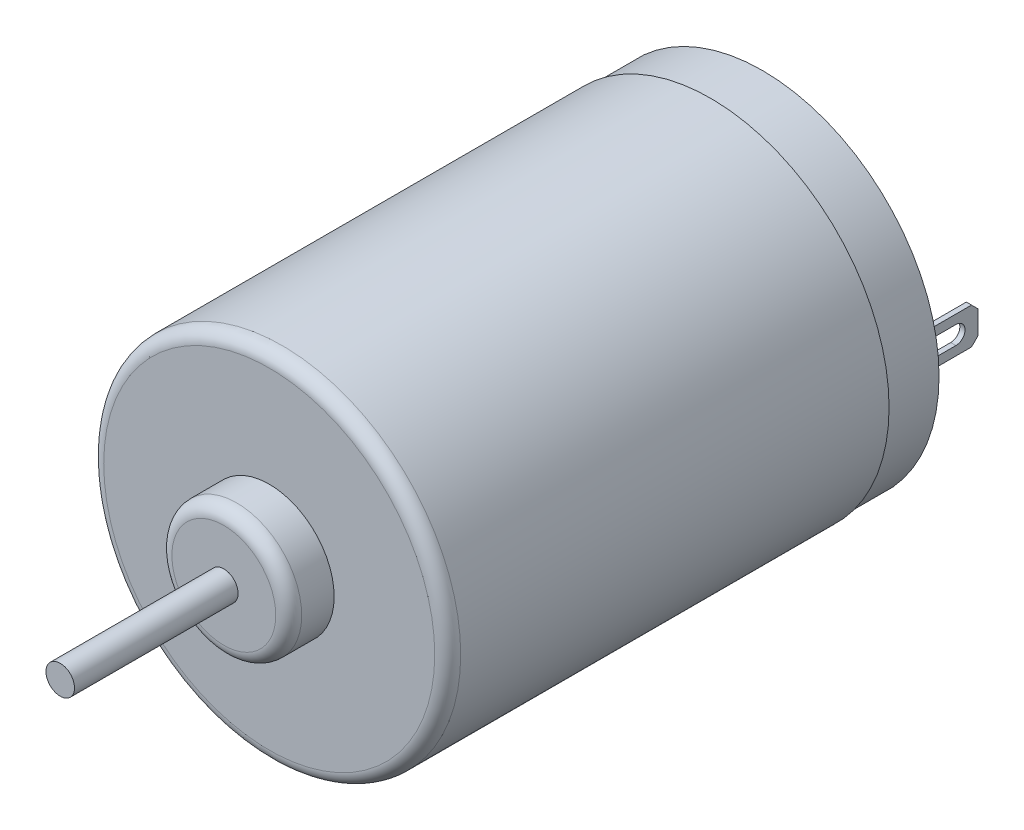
ISO-10303-21;
HEADER;
FILE_DESCRIPTION(('STEP AP214'),'2;1');
FILE_NAME('part.step','',(''),(''),'','','');
FILE_SCHEMA(('AUTOMOTIVE_DESIGN { 1 0 10303 214 1 1 1 1 }'));
ENDSEC;
DATA;
#1=APPLICATION_CONTEXT('core data for automotive mechanical design processes');
#2=APPLICATION_PROTOCOL_DEFINITION('international standard','automotive_design',2000,#1);
#3=PRODUCT_CONTEXT('',#1,'mechanical');
#4=PRODUCT('Part','Part','',(#3));
#5=PRODUCT_RELATED_PRODUCT_CATEGORY('part','',(#4));
#6=PRODUCT_DEFINITION_FORMATION('','',#4);
#7=PRODUCT_DEFINITION_CONTEXT('part definition',#1,'design');
#8=PRODUCT_DEFINITION('design','',#6,#7);
#9=PRODUCT_DEFINITION_SHAPE('','',#8);
#10=(LENGTH_UNIT() NAMED_UNIT(*) SI_UNIT(.MILLI.,.METRE.));
#11=(NAMED_UNIT(*) PLANE_ANGLE_UNIT() SI_UNIT($,.RADIAN.));
#12=(NAMED_UNIT(*) SI_UNIT($,.STERADIAN.) SOLID_ANGLE_UNIT());
#13=UNCERTAINTY_MEASURE_WITH_UNIT(LENGTH_MEASURE(1.E-05),#10,'distance_accuracy_value','');
#14=(GEOMETRIC_REPRESENTATION_CONTEXT(3) GLOBAL_UNCERTAINTY_ASSIGNED_CONTEXT((#13)) GLOBAL_UNIT_ASSIGNED_CONTEXT((#10,
#11,#12)) REPRESENTATION_CONTEXT('',''));
#15=CARTESIAN_POINT('',(0.,0.,0.));
#16=DIRECTION('',(0.,0.,1.));
#17=DIRECTION('',(1.,0.,0.));
#18=AXIS2_PLACEMENT_3D('',#15,#16,#17);
#19=CARTESIAN_POINT('',(-11.5,1.4,-9.1));
#20=DIRECTION('',(-1.,0.,0.));
#21=DIRECTION('',(0.,0.,1.));
#22=AXIS2_PLACEMENT_3D('',#19,#20,#21);
#23=PLANE('',#22);
#24=DIRECTION('',(0.,0.,-1.));
#25=VECTOR('',#24,1.);
#26=CARTESIAN_POINT('',(-11.5,-0.7,-5.8));
#27=LINE('',#26,#25);
#28=CARTESIAN_POINT('',(-11.5,-0.7,-5.8));
#29=VERTEX_POINT('',#28);
#30=CARTESIAN_POINT('',(-11.5,-0.7,-7.4));
#31=VERTEX_POINT('',#30);
#32=EDGE_CURVE('E364',#29,#31,#27,.T.);
#33=ORIENTED_EDGE('',*,*,#32,.T.);
#34=CARTESIAN_POINT('',(-11.5,0.,-7.4));
#35=DIRECTION('',(1.,0.,0.));
#36=DIRECTION('',(0.,0.,-1.));
#37=AXIS2_PLACEMENT_3D('',#34,#35,#36);
#38=CIRCLE('',#37,0.7);
#39=CARTESIAN_POINT('',(-11.5,0.7,-7.4));
#40=VERTEX_POINT('',#39);
#41=EDGE_CURVE('E361',#31,#40,#38,.T.);
#42=ORIENTED_EDGE('',*,*,#41,.T.);
#43=DIRECTION('',(0.,0.,1.));
#44=VECTOR('',#43,1.);
#45=CARTESIAN_POINT('',(-11.5,0.7,-5.8));
#46=LINE('',#45,#44);
#47=CARTESIAN_POINT('',(-11.5,0.7,-5.8));
#48=VERTEX_POINT('',#47);
#49=EDGE_CURVE('E374',#40,#48,#46,.T.);
#50=ORIENTED_EDGE('',*,*,#49,.T.);
#51=CARTESIAN_POINT('',(-11.5,0.,-5.8));
#52=DIRECTION('',(1.,0.,0.));
#53=DIRECTION('',(0.,0.,1.));
#54=AXIS2_PLACEMENT_3D('',#51,#52,#53);
#55=CIRCLE('',#54,0.7);
#56=EDGE_CURVE('E371',#48,#29,#55,.T.);
#57=ORIENTED_EDGE('',*,*,#56,.T.);
#58=EDGE_LOOP('',(#33,#42,#50,#57));
#59=FACE_BOUND('',#58,.T.);
#60=DIRECTION('',(0.,-1.,0.));
#61=VECTOR('',#60,1.);
#62=CARTESIAN_POINT('',(-11.5,1.4,-9.1));
#63=LINE('',#62,#61);
#64=CARTESIAN_POINT('',(-11.5,0.9,-9.1));
#65=VERTEX_POINT('',#64);
#66=CARTESIAN_POINT('',(-11.5,-0.9,-9.1));
#67=VERTEX_POINT('',#66);
#68=EDGE_CURVE('E181',#65,#67,#63,.T.);
#69=ORIENTED_EDGE('',*,*,#68,.T.);
#70=DIRECTION('',(0.,-0.707106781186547,0.707106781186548));
#71=VECTOR('',#70,1.);
#72=CARTESIAN_POINT('',(-11.5,-1.4,-8.6));
#73=LINE('',#72,#71);
#74=CARTESIAN_POINT('',(-11.5,-1.4,-8.6));
#75=VERTEX_POINT('',#74);
#76=EDGE_CURVE('E169',#67,#75,#73,.T.);
#77=ORIENTED_EDGE('',*,*,#76,.T.);
#78=DIRECTION('',(0.,0.,1.));
#79=VECTOR('',#78,1.);
#80=CARTESIAN_POINT('',(-11.5,-1.4,-9.1));
#81=LINE('',#80,#79);
#82=CARTESIAN_POINT('',(-11.5,-1.4,-4.));
#83=VERTEX_POINT('',#82);
#84=EDGE_CURVE('E188',#75,#83,#81,.T.);
#85=ORIENTED_EDGE('',*,*,#84,.T.);
#86=DIRECTION('',(0.,-1.,0.));
#87=VECTOR('',#86,1.);
#88=CARTESIAN_POINT('',(-11.5,1.4,-4.));
#89=LINE('',#88,#87);
#90=CARTESIAN_POINT('',(-11.5,1.4,-4.));
#91=VERTEX_POINT('',#90);
#92=EDGE_CURVE('E197',#91,#83,#89,.T.);
#93=ORIENTED_EDGE('',*,*,#92,.F.);
#94=DIRECTION('',(0.,0.,1.));
#95=VECTOR('',#94,1.);
#96=CARTESIAN_POINT('',(-11.5,1.4,-9.1));
#97=LINE('',#96,#95);
#98=CARTESIAN_POINT('',(-11.5,1.4,-8.6));
#99=VERTEX_POINT('',#98);
#100=EDGE_CURVE('E211',#99,#91,#97,.T.);
#101=ORIENTED_EDGE('',*,*,#100,.F.);
#102=DIRECTION('',(0.,-0.707106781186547,-0.707106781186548));
#103=VECTOR('',#102,1.);
#104=CARTESIAN_POINT('',(-11.5,1.4,-8.6));
#105=LINE('',#104,#103);
#106=EDGE_CURVE('E185',#99,#65,#105,.T.);
#107=ORIENTED_EDGE('',*,*,#106,.T.);
#108=EDGE_LOOP('',(#69,#77,#85,#93,#101,#107));
#109=FACE_BOUND('',#108,.T.);
#110=ADVANCED_FACE('F34',(#59,#109),#23,.T.);
#111=CARTESIAN_POINT('',(-11.1,1.4,-9.1));
#112=DIRECTION('',(1.,0.,0.));
#113=DIRECTION('',(0.,0.,-1.));
#114=AXIS2_PLACEMENT_3D('',#111,#112,#113);
#115=PLANE('',#114);
#116=DIRECTION('',(0.,0.,-1.));
#117=VECTOR('',#116,1.);
#118=CARTESIAN_POINT('',(-11.1,0.7,-9.1));
#119=LINE('',#118,#117);
#120=CARTESIAN_POINT('',(-11.1,0.7,-5.8));
#121=VERTEX_POINT('',#120);
#122=CARTESIAN_POINT('',(-11.1,0.7,-7.4));
#123=VERTEX_POINT('',#122);
#124=EDGE_CURVE('E350',#121,#123,#119,.T.);
#125=ORIENTED_EDGE('',*,*,#124,.T.);
#126=CARTESIAN_POINT('',(-11.1,0.,-7.4));
#127=DIRECTION('',(1.,0.,0.));
#128=DIRECTION('',(0.,0.,-1.));
#129=AXIS2_PLACEMENT_3D('',#126,#127,#128);
#130=CIRCLE('',#129,0.7);
#131=CARTESIAN_POINT('',(-11.1,-0.7,-7.4));
#132=VERTEX_POINT('',#131);
#133=EDGE_CURVE('E353',#123,#132,#130,.F.);
#134=ORIENTED_EDGE('',*,*,#133,.T.);
#135=DIRECTION('',(0.,0.,1.));
#136=VECTOR('',#135,1.);
#137=CARTESIAN_POINT('',(-11.1,-0.7,-9.1));
#138=LINE('',#137,#136);
#139=CARTESIAN_POINT('',(-11.1,-0.7,-5.8));
#140=VERTEX_POINT('',#139);
#141=EDGE_CURVE('E344',#132,#140,#138,.T.);
#142=ORIENTED_EDGE('',*,*,#141,.T.);
#143=CARTESIAN_POINT('',(-11.1,0.,-5.8));
#144=DIRECTION('',(1.,0.,0.));
#145=DIRECTION('',(0.,0.,-1.));
#146=AXIS2_PLACEMENT_3D('',#143,#144,#145);
#147=CIRCLE('',#146,0.7);
#148=EDGE_CURVE('E347',#140,#121,#147,.F.);
#149=ORIENTED_EDGE('',*,*,#148,.T.);
#150=EDGE_LOOP('',(#125,#134,#142,#149));
#151=FACE_BOUND('',#150,.T.);
#152=DIRECTION('',(0.,0.,1.));
#153=VECTOR('',#152,1.);
#154=CARTESIAN_POINT('',(-11.1,-1.4,-9.1));
#155=LINE('',#154,#153);
#156=CARTESIAN_POINT('',(-11.1,-1.4,-8.6));
#157=VERTEX_POINT('',#156);
#158=CARTESIAN_POINT('',(-11.1,-1.4,-4.));
#159=VERTEX_POINT('',#158);
#160=EDGE_CURVE('E207',#157,#159,#155,.T.);
#161=ORIENTED_EDGE('',*,*,#160,.F.);
#162=DIRECTION('',(0.,0.707106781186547,-0.707106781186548));
#163=VECTOR('',#162,1.);
#164=CARTESIAN_POINT('',(-11.1,0.249999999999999,-10.25));
#165=LINE('',#164,#163);
#166=CARTESIAN_POINT('',(-11.1,-0.9,-9.1));
#167=VERTEX_POINT('',#166);
#168=EDGE_CURVE('E49',#157,#167,#165,.T.);
#169=ORIENTED_EDGE('',*,*,#168,.T.);
#170=DIRECTION('',(0.,1.,0.));
#171=VECTOR('',#170,1.);
#172=CARTESIAN_POINT('',(-11.1,1.4,-9.1));
#173=LINE('',#172,#171);
#174=CARTESIAN_POINT('',(-11.1,0.9,-9.1));
#175=VERTEX_POINT('',#174);
#176=EDGE_CURVE('E55',#167,#175,#173,.T.);
#177=ORIENTED_EDGE('',*,*,#176,.T.);
#178=DIRECTION('',(0.,0.707106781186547,0.707106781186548));
#179=VECTOR('',#178,1.);
#180=CARTESIAN_POINT('',(-11.1,1.15,-8.85));
#181=LINE('',#180,#179);
#182=CARTESIAN_POINT('',(-11.1,1.4,-8.6));
#183=VERTEX_POINT('',#182);
#184=EDGE_CURVE('E358',#175,#183,#181,.T.);
#185=ORIENTED_EDGE('',*,*,#184,.T.);
#186=DIRECTION('',(0.,0.,1.));
#187=VECTOR('',#186,1.);
#188=CARTESIAN_POINT('',(-11.1,1.4,-9.1));
#189=LINE('',#188,#187);
#190=CARTESIAN_POINT('',(-11.1,1.4,-4.));
#191=VERTEX_POINT('',#190);
#192=EDGE_CURVE('E209',#183,#191,#189,.T.);
#193=ORIENTED_EDGE('',*,*,#192,.T.);
#194=DIRECTION('',(0.,1.,0.));
#195=VECTOR('',#194,1.);
#196=CARTESIAN_POINT('',(-11.1,1.4,-4.));
#197=LINE('',#196,#195);
#198=EDGE_CURVE('E191',#159,#191,#197,.T.);
#199=ORIENTED_EDGE('',*,*,#198,.F.);
#200=EDGE_LOOP('',(#161,#169,#177,#185,#193,#199));
#201=FACE_BOUND('',#200,.T.);
#202=ADVANCED_FACE('F395',(#151,#201),#115,.T.);
#203=CARTESIAN_POINT('',(-11.5,-1.4,-9.1));
#204=DIRECTION('',(0.,0.,-1.));
#205=DIRECTION('',(1.,0.,0.));
#206=AXIS2_PLACEMENT_3D('',#203,#204,#205);
#207=PLANE('',#206);
#208=ORIENTED_EDGE('',*,*,#176,.F.);
#209=DIRECTION('',(-1.,0.,0.));
#210=VECTOR('',#209,1.);
#211=CARTESIAN_POINT('',(-11.,-0.9,-9.1));
#212=LINE('',#211,#210);
#213=EDGE_CURVE('E172',#167,#67,#212,.T.);
#214=ORIENTED_EDGE('',*,*,#213,.T.);
#215=ORIENTED_EDGE('',*,*,#68,.F.);
#216=DIRECTION('',(1.,0.,0.));
#217=VECTOR('',#216,1.);
#218=CARTESIAN_POINT('',(-11.5,0.9,-9.1));
#219=LINE('',#218,#217);
#220=EDGE_CURVE('E42',#65,#175,#219,.T.);
#221=ORIENTED_EDGE('',*,*,#220,.T.);
#222=EDGE_LOOP('',(#208,#214,#215,#221));
#223=FACE_BOUND('',#222,.T.);
#224=ADVANCED_FACE('F179',(#223),#207,.T.);
#225=CARTESIAN_POINT('',(-11.5,-1.4,-9.1));
#226=DIRECTION('',(0.,-1.,0.));
#227=DIRECTION('',(0.,0.,-1.));
#228=AXIS2_PLACEMENT_3D('',#225,#226,#227);
#229=PLANE('',#228);
#230=ORIENTED_EDGE('',*,*,#84,.F.);
#231=DIRECTION('',(1.,0.,0.));
#232=VECTOR('',#231,1.);
#233=CARTESIAN_POINT('',(-11.5,-1.4,-8.6));
#234=LINE('',#233,#232);
#235=EDGE_CURVE('E11',#75,#157,#234,.T.);
#236=ORIENTED_EDGE('',*,*,#235,.T.);
#237=ORIENTED_EDGE('',*,*,#160,.T.);
#238=DIRECTION('',(1.,0.,0.));
#239=VECTOR('',#238,1.);
#240=CARTESIAN_POINT('',(-11.5,-1.4,-4.));
#241=LINE('',#240,#239);
#242=EDGE_CURVE('E186',#83,#159,#241,.T.);
#243=ORIENTED_EDGE('',*,*,#242,.F.);
#244=EDGE_LOOP('',(#230,#236,#237,#243));
#245=FACE_BOUND('',#244,.T.);
#246=ADVANCED_FACE('F573',(#245),#229,.T.);
#247=CARTESIAN_POINT('',(-11.5,1.4,-9.1));
#248=DIRECTION('',(0.,1.,0.));
#249=DIRECTION('',(0.,0.,1.));
#250=AXIS2_PLACEMENT_3D('',#247,#248,#249);
#251=PLANE('',#250);
#252=ORIENTED_EDGE('',*,*,#192,.F.);
#253=DIRECTION('',(-1.,0.,0.));
#254=VECTOR('',#253,1.);
#255=CARTESIAN_POINT('',(-11.,1.4,-8.6));
#256=LINE('',#255,#254);
#257=EDGE_CURVE('E359',#183,#99,#256,.T.);
#258=ORIENTED_EDGE('',*,*,#257,.T.);
#259=ORIENTED_EDGE('',*,*,#100,.T.);
#260=DIRECTION('',(-1.,0.,0.));
#261=VECTOR('',#260,1.);
#262=CARTESIAN_POINT('',(-11.5,1.4,-4.));
#263=LINE('',#262,#261);
#264=EDGE_CURVE('E200',#191,#91,#263,.T.);
#265=ORIENTED_EDGE('',*,*,#264,.F.);
#266=EDGE_LOOP('',(#252,#258,#259,#265));
#267=FACE_BOUND('',#266,.T.);
#268=ADVANCED_FACE('F416',(#267),#251,.T.);
#269=CARTESIAN_POINT('',(0.,0.,-4.));
#270=DIRECTION('',(0.,0.,-1.));
#271=DIRECTION('',(-1.,0.,0.));
#272=AXIS2_PLACEMENT_3D('',#269,#270,#271);
#273=PLANE('',#272);
#274=ORIENTED_EDGE('',*,*,#92,.T.);
#275=ORIENTED_EDGE('',*,*,#242,.T.);
#276=ORIENTED_EDGE('',*,*,#198,.T.);
#277=ORIENTED_EDGE('',*,*,#264,.T.);
#278=EDGE_LOOP('',(#274,#275,#276,#277));
#279=FACE_BOUND('',#278,.T.);
#280=CARTESIAN_POINT('',(0.,0.,-4.));
#281=DIRECTION('',(0.,0.,-1.));
#282=DIRECTION('',(-1.,0.,0.));
#283=AXIS2_PLACEMENT_3D('',#280,#281,#282);
#284=CIRCLE('',#283,13.6);
#285=CARTESIAN_POINT('',(-13.6,0.,-4.));
#286=VERTEX_POINT('',#285);
#287=EDGE_CURVE('E295',#286,#286,#284,.T.);
#288=ORIENTED_EDGE('',*,*,#287,.T.);
#289=EDGE_LOOP('',(#288));
#290=FACE_BOUND('',#289,.T.);
#291=CARTESIAN_POINT('',(0.,0.,-4.));
#292=DIRECTION('',(0.,0.,-1.));
#293=DIRECTION('',(-1.,0.,0.));
#294=AXIS2_PLACEMENT_3D('',#291,#292,#293);
#295=CIRCLE('',#294,10.8454911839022);
#296=CARTESIAN_POINT('',(-10.8454911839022,0.,-4.));
#297=VERTEX_POINT('',#296);
#298=EDGE_CURVE('E289',#297,#297,#295,.T.);
#299=ORIENTED_EDGE('',*,*,#298,.F.);
#300=EDGE_LOOP('',(#299));
#301=FACE_BOUND('',#300,.T.);
#302=DIRECTION('',(-1.,0.,0.));
#303=VECTOR('',#302,1.);
#304=CARTESIAN_POINT('',(11.5,-1.4,-4.));
#305=LINE('',#304,#303);
#306=CARTESIAN_POINT('',(11.5,-1.4,-4.));
#307=VERTEX_POINT('',#306);
#308=CARTESIAN_POINT('',(11.1,-1.4,-4.));
#309=VERTEX_POINT('',#308);
#310=EDGE_CURVE('E258',#307,#309,#305,.T.);
#311=ORIENTED_EDGE('',*,*,#310,.F.);
#312=DIRECTION('',(0.,-1.,0.));
#313=VECTOR('',#312,1.);
#314=CARTESIAN_POINT('',(11.5,1.4,-4.));
#315=LINE('',#314,#313);
#316=CARTESIAN_POINT('',(11.5,1.4,-4.));
#317=VERTEX_POINT('',#316);
#318=EDGE_CURVE('E242',#317,#307,#315,.T.);
#319=ORIENTED_EDGE('',*,*,#318,.F.);
#320=DIRECTION('',(1.,0.,0.));
#321=VECTOR('',#320,1.);
#322=CARTESIAN_POINT('',(11.5,1.4,-4.));
#323=LINE('',#322,#321);
#324=CARTESIAN_POINT('',(11.1,1.4,-4.));
#325=VERTEX_POINT('',#324);
#326=EDGE_CURVE('E253',#325,#317,#323,.T.);
#327=ORIENTED_EDGE('',*,*,#326,.F.);
#328=DIRECTION('',(0.,1.,0.));
#329=VECTOR('',#328,1.);
#330=CARTESIAN_POINT('',(11.1,1.4,-4.));
#331=LINE('',#330,#329);
#332=EDGE_CURVE('E261',#309,#325,#331,.T.);
#333=ORIENTED_EDGE('',*,*,#332,.F.);
#334=EDGE_LOOP('',(#311,#319,#327,#333));
#335=FACE_BOUND('',#334,.T.);
#336=ADVANCED_FACE('F475',(#279,#290,#301,#335),#273,.T.);
#337=CARTESIAN_POINT('',(0.,0.,-6.2));
#338=DIRECTION('',(0.,0.,-1.));
#339=DIRECTION('',(-1.,0.,0.));
#340=AXIS2_PLACEMENT_3D('',#337,#338,#339);
#341=PLANE('',#340);
#342=CARTESIAN_POINT('',(0.,0.,-6.2));
#343=DIRECTION('',(0.,0.,-1.));
#344=DIRECTION('',(-1.,0.,0.));
#345=AXIS2_PLACEMENT_3D('',#342,#343,#344);
#346=CIRCLE('',#345,5.);
#347=CARTESIAN_POINT('',(-5.,0.,-6.2));
#348=VERTEX_POINT('',#347);
#349=EDGE_CURVE('E280',#348,#348,#346,.T.);
#350=ORIENTED_EDGE('',*,*,#349,.T.);
#351=EDGE_LOOP('',(#350));
#352=FACE_BOUND('',#351,.T.);
#353=CARTESIAN_POINT('',(0.,0.,-6.2));
#354=DIRECTION('',(0.,0.,-1.));
#355=DIRECTION('',(-1.,0.,0.));
#356=AXIS2_PLACEMENT_3D('',#353,#354,#355);
#357=CIRCLE('',#356,1.1);
#358=CARTESIAN_POINT('',(-1.1,0.,-6.2));
#359=VERTEX_POINT('',#358);
#360=EDGE_CURVE('E273',#359,#359,#357,.T.);
#361=ORIENTED_EDGE('',*,*,#360,.F.);
#362=EDGE_LOOP('',(#361));
#363=FACE_BOUND('',#362,.T.);
#364=ADVANCED_FACE('F471',(#352,#363),#341,.T.);
#365=CARTESIAN_POINT('',(0.,0.,-4.));
#366=DIRECTION('',(0.,0.,-1.));
#367=DIRECTION('',(-1.,0.,0.));
#368=AXIS2_PLACEMENT_3D('',#365,#366,#367);
#369=CIRCLE('',#368,6.);
#370=CARTESIAN_POINT('',(-6.,0.,-4.));
#371=VERTEX_POINT('',#370);
#372=EDGE_CURVE('E283',#371,#371,#369,.T.);
#373=ORIENTED_EDGE('',*,*,#372,.T.);
#374=EDGE_LOOP('',(#373));
#375=FACE_BOUND('',#374,.T.);
#376=CARTESIAN_POINT('',(0.,0.,-4.));
#377=DIRECTION('',(0.,0.,-1.));
#378=DIRECTION('',(-1.,0.,0.));
#379=AXIS2_PLACEMENT_3D('',#376,#377,#378);
#380=CIRCLE('',#379,5.);
#381=CARTESIAN_POINT('',(-5.,0.,-4.));
#382=VERTEX_POINT('',#381);
#383=EDGE_CURVE('E277',#382,#382,#380,.T.);
#384=ORIENTED_EDGE('',*,*,#383,.F.);
#385=EDGE_LOOP('',(#384));
#386=FACE_BOUND('',#385,.T.);
#387=ADVANCED_FACE('F474',(#375,#386),#273,.T.);
#388=CARTESIAN_POINT('',(0.,0.,0.));
#389=DIRECTION('',(0.,0.,1.));
#390=DIRECTION('',(1.,0.,0.));
#391=AXIS2_PLACEMENT_3D('',#388,#389,#390);
#392=PLANE('',#391);
#393=CARTESIAN_POINT('',(0.,0.,0.));
#394=DIRECTION('',(0.,0.,1.));
#395=DIRECTION('',(1.,0.,0.));
#396=AXIS2_PLACEMENT_3D('',#393,#394,#395);
#397=CIRCLE('',#396,13.75);
#398=CARTESIAN_POINT('',(13.75,0.,0.));
#399=VERTEX_POINT('',#398);
#400=EDGE_CURVE('E309',#399,#399,#397,.T.);
#401=ORIENTED_EDGE('',*,*,#400,.F.);
#402=EDGE_LOOP('',(#401));
#403=FACE_BOUND('',#402,.T.);
#404=CARTESIAN_POINT('',(0.,0.,0.));
#405=DIRECTION('',(0.,0.,1.));
#406=DIRECTION('',(1.,0.,0.));
#407=AXIS2_PLACEMENT_3D('',#404,#405,#406);
#408=CIRCLE('',#407,13.6);
#409=CARTESIAN_POINT('',(13.6,0.,0.));
#410=VERTEX_POINT('',#409);
#411=EDGE_CURVE('E312',#410,#410,#408,.F.);
#412=ORIENTED_EDGE('',*,*,#411,.F.);
#413=EDGE_LOOP('',(#412));
#414=FACE_BOUND('',#413,.T.);
#415=ADVANCED_FACE('F512',(#403,#414),#392,.F.);
#416=CARTESIAN_POINT('',(0.,0.,37.5));
#417=DIRECTION('',(0.,0.,1.));
#418=DIRECTION('',(1.,0.,0.));
#419=AXIS2_PLACEMENT_3D('',#416,#417,#418);
#420=PLANE('',#419);
#421=CARTESIAN_POINT('',(0.,0.,37.5));
#422=DIRECTION('',(0.,0.,1.));
#423=DIRECTION('',(1.,0.,0.));
#424=AXIS2_PLACEMENT_3D('',#421,#422,#423);
#425=CIRCLE('',#424,4.);
#426=CARTESIAN_POINT('',(4.,0.,37.5));
#427=VERTEX_POINT('',#426);
#428=EDGE_CURVE('E332',#427,#427,#425,.T.);
#429=ORIENTED_EDGE('',*,*,#428,.T.);
#430=EDGE_LOOP('',(#429));
#431=FACE_BOUND('',#430,.T.);
#432=CARTESIAN_POINT('',(0.,0.,37.5));
#433=DIRECTION('',(0.,0.,1.));
#434=DIRECTION('',(1.,0.,0.));
#435=AXIS2_PLACEMENT_3D('',#432,#433,#434);
#436=CIRCLE('',#435,1.1);
#437=CARTESIAN_POINT('',(1.1,0.,37.5));
#438=VERTEX_POINT('',#437);
#439=EDGE_CURVE('E300',#438,#438,#436,.T.);
#440=ORIENTED_EDGE('',*,*,#439,.F.);
#441=EDGE_LOOP('',(#440));
#442=FACE_BOUND('',#441,.T.);
#443=ADVANCED_FACE('F508',(#431,#442),#420,.T.);
#444=CARTESIAN_POINT('',(0.,0.,34.));
#445=DIRECTION('',(0.,0.,1.));
#446=DIRECTION('',(1.,0.,0.));
#447=AXIS2_PLACEMENT_3D('',#444,#445,#446);
#448=PLANE('',#447);
#449=CARTESIAN_POINT('',(0.,0.,34.));
#450=DIRECTION('',(0.,0.,1.));
#451=DIRECTION('',(1.,0.,0.));
#452=AXIS2_PLACEMENT_3D('',#449,#450,#451);
#453=CIRCLE('',#452,12.75);
#454=CARTESIAN_POINT('',(12.75,0.,34.));
#455=VERTEX_POINT('',#454);
#456=EDGE_CURVE('E338',#455,#455,#453,.T.);
#457=ORIENTED_EDGE('',*,*,#456,.T.);
#458=EDGE_LOOP('',(#457));
#459=FACE_BOUND('',#458,.T.);
#460=CARTESIAN_POINT('',(0.,0.,34.));
#461=DIRECTION('',(0.,0.,1.));
#462=DIRECTION('',(1.,0.,0.));
#463=AXIS2_PLACEMENT_3D('',#460,#461,#462);
#464=CIRCLE('',#463,5.);
#465=CARTESIAN_POINT('',(5.,0.,34.));
#466=VERTEX_POINT('',#465);
#467=EDGE_CURVE('E304',#466,#466,#464,.T.);
#468=ORIENTED_EDGE('',*,*,#467,.F.);
#469=EDGE_LOOP('',(#468));
#470=FACE_BOUND('',#469,.T.);
#471=ADVANCED_FACE('F511',(#459,#470),#448,.T.);
#472=CARTESIAN_POINT('',(0.,0.,34.));
#473=DIRECTION('',(0.,0.,-1.));
#474=DIRECTION('',(-1.,0.,0.));
#475=AXIS2_PLACEMENT_3D('',#472,#473,#474);
#476=CYLINDRICAL_SURFACE('',#475,13.75);
#477=CARTESIAN_POINT('',(0.,0.,33.));
#478=DIRECTION('',(0.,0.,1.));
#479=DIRECTION('',(1.,0.,0.));
#480=AXIS2_PLACEMENT_3D('',#477,#478,#479);
#481=CIRCLE('',#480,13.75);
#482=CARTESIAN_POINT('',(13.75,0.,33.));
#483=VERTEX_POINT('',#482);
#484=EDGE_CURVE('E341',#483,#483,#481,.F.);
#485=ORIENTED_EDGE('',*,*,#484,.T.);
#486=EDGE_LOOP('',(#485));
#487=FACE_BOUND('',#486,.T.);
#488=ORIENTED_EDGE('',*,*,#400,.T.);
#489=EDGE_LOOP('',(#488));
#490=FACE_BOUND('',#489,.T.);
#491=ADVANCED_FACE('F516',(#487,#490),#476,.T.);
#492=CARTESIAN_POINT('',(0.,0.,37.5));
#493=DIRECTION('',(0.,0.,-1.));
#494=DIRECTION('',(-1.,0.,0.));
#495=AXIS2_PLACEMENT_3D('',#492,#493,#494);
#496=CYLINDRICAL_SURFACE('',#495,5.);
#497=CARTESIAN_POINT('',(0.,0.,36.5));
#498=DIRECTION('',(0.,0.,1.));
#499=DIRECTION('',(1.,0.,0.));
#500=AXIS2_PLACEMENT_3D('',#497,#498,#499);
#501=CIRCLE('',#500,5.);
#502=CARTESIAN_POINT('',(5.,0.,36.5));
#503=VERTEX_POINT('',#502);
#504=EDGE_CURVE('E335',#503,#503,#501,.F.);
#505=ORIENTED_EDGE('',*,*,#504,.T.);
#506=EDGE_LOOP('',(#505));
#507=FACE_BOUND('',#506,.T.);
#508=ORIENTED_EDGE('',*,*,#467,.T.);
#509=EDGE_LOOP('',(#508));
#510=FACE_BOUND('',#509,.T.);
#511=ADVANCED_FACE('F506',(#507,#510),#496,.T.);
#512=CARTESIAN_POINT('',(0.,0.,50.1));
#513=DIRECTION('',(0.,0.,-1.));
#514=DIRECTION('',(-1.,0.,0.));
#515=AXIS2_PLACEMENT_3D('',#512,#513,#514);
#516=CYLINDRICAL_SURFACE('',#515,1.1);
#517=CARTESIAN_POINT('',(0.,0.,50.1));
#518=DIRECTION('',(0.,0.,1.));
#519=DIRECTION('',(1.,0.,0.));
#520=AXIS2_PLACEMENT_3D('',#517,#518,#519);
#521=CIRCLE('',#520,1.1);
#522=CARTESIAN_POINT('',(1.1,0.,50.1));
#523=VERTEX_POINT('',#522);
#524=EDGE_CURVE('E301',#523,#523,#521,.T.);
#525=ORIENTED_EDGE('',*,*,#524,.F.);
#526=EDGE_LOOP('',(#525));
#527=FACE_BOUND('',#526,.T.);
#528=ORIENTED_EDGE('',*,*,#439,.T.);
#529=EDGE_LOOP('',(#528));
#530=FACE_BOUND('',#529,.T.);
#531=ADVANCED_FACE('F502',(#527,#530),#516,.T.);
#532=CARTESIAN_POINT('',(0.,0.,50.1));
#533=DIRECTION('',(0.,0.,1.));
#534=DIRECTION('',(1.,0.,0.));
#535=AXIS2_PLACEMENT_3D('',#532,#533,#534);
#536=PLANE('',#535);
#537=ORIENTED_EDGE('',*,*,#524,.T.);
#538=EDGE_LOOP('',(#537));
#539=FACE_BOUND('',#538,.T.);
#540=ADVANCED_FACE('F498',(#539),#536,.T.);
#541=CARTESIAN_POINT('',(0.,0.,-4.));
#542=DIRECTION('',(0.,0.,1.));
#543=DIRECTION('',(1.,0.,0.));
#544=AXIS2_PLACEMENT_3D('',#541,#542,#543);
#545=CYLINDRICAL_SURFACE('',#544,13.6);
#546=ORIENTED_EDGE('',*,*,#287,.F.);
#547=EDGE_LOOP('',(#546));
#548=FACE_BOUND('',#547,.T.);
#549=ORIENTED_EDGE('',*,*,#411,.T.);
#550=EDGE_LOOP('',(#549));
#551=FACE_BOUND('',#550,.T.);
#552=ADVANCED_FACE('F491',(#548,#551),#545,.T.);
#553=CARTESIAN_POINT('',(0.,0.,-3.));
#554=DIRECTION('',(0.,0.,-1.));
#555=DIRECTION('',(-1.,0.,0.));
#556=AXIS2_PLACEMENT_3D('',#553,#554,#555);
#557=CYLINDRICAL_SURFACE('',#556,10.8454911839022);
#558=CARTESIAN_POINT('',(0.,0.,-3.));
#559=DIRECTION('',(0.,0.,-1.));
#560=DIRECTION('',(-1.,0.,0.));
#561=AXIS2_PLACEMENT_3D('',#558,#559,#560);
#562=CIRCLE('',#561,10.8454911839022);
#563=CARTESIAN_POINT('',(-10.8454911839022,0.,-3.));
#564=VERTEX_POINT('',#563);
#565=EDGE_CURVE('E292',#564,#564,#562,.T.);
#566=ORIENTED_EDGE('',*,*,#565,.F.);
#567=EDGE_LOOP('',(#566));
#568=FACE_BOUND('',#567,.T.);
#569=ORIENTED_EDGE('',*,*,#298,.T.);
#570=EDGE_LOOP('',(#569));
#571=FACE_BOUND('',#570,.T.);
#572=ADVANCED_FACE('F487',(#568,#571),#557,.F.);
#573=CARTESIAN_POINT('',(0.,0.,-3.));
#574=DIRECTION('',(0.,0.,-1.));
#575=DIRECTION('',(-1.,0.,0.));
#576=AXIS2_PLACEMENT_3D('',#573,#574,#575);
#577=PLANE('',#576);
#578=CARTESIAN_POINT('',(0.,0.,-3.));
#579=DIRECTION('',(0.,0.,-1.));
#580=DIRECTION('',(-1.,0.,0.));
#581=AXIS2_PLACEMENT_3D('',#578,#579,#580);
#582=CIRCLE('',#581,6.);
#583=CARTESIAN_POINT('',(-6.,0.,-3.));
#584=VERTEX_POINT('',#583);
#585=EDGE_CURVE('E286',#584,#584,#582,.T.);
#586=ORIENTED_EDGE('',*,*,#585,.F.);
#587=EDGE_LOOP('',(#586));
#588=FACE_BOUND('',#587,.T.);
#589=ORIENTED_EDGE('',*,*,#565,.T.);
#590=EDGE_LOOP('',(#589));
#591=FACE_BOUND('',#590,.T.);
#592=ADVANCED_FACE('F483',(#588,#591),#577,.T.);
#593=CARTESIAN_POINT('',(0.,0.,-3.));
#594=DIRECTION('',(0.,0.,-1.));
#595=DIRECTION('',(-1.,0.,0.));
#596=AXIS2_PLACEMENT_3D('',#593,#594,#595);
#597=CYLINDRICAL_SURFACE('',#596,6.);
#598=ORIENTED_EDGE('',*,*,#585,.T.);
#599=EDGE_LOOP('',(#598));
#600=FACE_BOUND('',#599,.T.);
#601=ORIENTED_EDGE('',*,*,#372,.F.);
#602=EDGE_LOOP('',(#601));
#603=FACE_BOUND('',#602,.T.);
#604=ADVANCED_FACE('F479',(#600,#603),#597,.T.);
#605=CARTESIAN_POINT('',(0.,0.,-6.2));
#606=DIRECTION('',(0.,0.,1.));
#607=DIRECTION('',(1.,0.,0.));
#608=AXIS2_PLACEMENT_3D('',#605,#606,#607);
#609=CYLINDRICAL_SURFACE('',#608,5.);
#610=ORIENTED_EDGE('',*,*,#349,.F.);
#611=EDGE_LOOP('',(#610));
#612=FACE_BOUND('',#611,.T.);
#613=ORIENTED_EDGE('',*,*,#383,.T.);
#614=EDGE_LOOP('',(#613));
#615=FACE_BOUND('',#614,.T.);
#616=ADVANCED_FACE('F469',(#612,#615),#609,.T.);
#617=CARTESIAN_POINT('',(0.,0.,-7.2));
#618=DIRECTION('',(0.,0.,1.));
#619=DIRECTION('',(1.,0.,0.));
#620=AXIS2_PLACEMENT_3D('',#617,#618,#619);
#621=CYLINDRICAL_SURFACE('',#620,1.1);
#622=CARTESIAN_POINT('',(0.,0.,-7.2));
#623=DIRECTION('',(0.,0.,-1.));
#624=DIRECTION('',(-1.,0.,0.));
#625=AXIS2_PLACEMENT_3D('',#622,#623,#624);
#626=CIRCLE('',#625,1.1);
#627=CARTESIAN_POINT('',(-1.1,0.,-7.2));
#628=VERTEX_POINT('',#627);
#629=EDGE_CURVE('E274',#628,#628,#626,.T.);
#630=ORIENTED_EDGE('',*,*,#629,.F.);
#631=EDGE_LOOP('',(#630));
#632=FACE_BOUND('',#631,.T.);
#633=ORIENTED_EDGE('',*,*,#360,.T.);
#634=EDGE_LOOP('',(#633));
#635=FACE_BOUND('',#634,.T.);
#636=ADVANCED_FACE('F465',(#632,#635),#621,.T.);
#637=CARTESIAN_POINT('',(0.,0.,-7.2));
#638=DIRECTION('',(0.,0.,-1.));
#639=DIRECTION('',(-1.,0.,0.));
#640=AXIS2_PLACEMENT_3D('',#637,#638,#639);
#641=PLANE('',#640);
#642=ORIENTED_EDGE('',*,*,#629,.T.);
#643=EDGE_LOOP('',(#642));
#644=FACE_BOUND('',#643,.T.);
#645=ADVANCED_FACE('F461',(#644),#641,.T.);
#646=CARTESIAN_POINT('',(11.5,1.4,-9.1));
#647=DIRECTION('',(-1.,0.,0.));
#648=DIRECTION('',(0.,0.,1.));
#649=AXIS2_PLACEMENT_3D('',#646,#647,#648);
#650=PLANE('',#649);
#651=DIRECTION('',(0.,0.,1.));
#652=VECTOR('',#651,1.);
#653=CARTESIAN_POINT('',(11.5,0.7,-5.8));
#654=LINE('',#653,#652);
#655=CARTESIAN_POINT('',(11.5,0.7,-7.4));
#656=VERTEX_POINT('',#655);
#657=CARTESIAN_POINT('',(11.5,0.7,-5.8));
#658=VERTEX_POINT('',#657);
#659=EDGE_CURVE('E230',#656,#658,#654,.T.);
#660=ORIENTED_EDGE('',*,*,#659,.F.);
#661=CARTESIAN_POINT('',(11.5,0.,-7.4));
#662=DIRECTION('',(1.,0.,0.));
#663=DIRECTION('',(0.,0.,-1.));
#664=AXIS2_PLACEMENT_3D('',#661,#662,#663);
#665=CIRCLE('',#664,0.7);
#666=CARTESIAN_POINT('',(11.5,-0.7,-7.4));
#667=VERTEX_POINT('',#666);
#668=EDGE_CURVE('E228',#667,#656,#665,.T.);
#669=ORIENTED_EDGE('',*,*,#668,.F.);
#670=DIRECTION('',(0.,0.,-1.));
#671=VECTOR('',#670,1.);
#672=CARTESIAN_POINT('',(11.5,-0.7,-5.8));
#673=LINE('',#672,#671);
#674=CARTESIAN_POINT('',(11.5,-0.7,-5.8));
#675=VERTEX_POINT('',#674);
#676=EDGE_CURVE('E236',#675,#667,#673,.T.);
#677=ORIENTED_EDGE('',*,*,#676,.F.);
#678=CARTESIAN_POINT('',(11.5,0.,-5.8));
#679=DIRECTION('',(1.,0.,0.));
#680=DIRECTION('',(0.,0.,1.));
#681=AXIS2_PLACEMENT_3D('',#678,#679,#680);
#682=CIRCLE('',#681,0.7);
#683=EDGE_CURVE('E233',#658,#675,#682,.T.);
#684=ORIENTED_EDGE('',*,*,#683,.F.);
#685=EDGE_LOOP('',(#660,#669,#677,#684));
#686=FACE_BOUND('',#685,.T.);
#687=DIRECTION('',(0.,0.,1.));
#688=VECTOR('',#687,1.);
#689=CARTESIAN_POINT('',(11.5,-1.4,-9.1));
#690=LINE('',#689,#688);
#691=CARTESIAN_POINT('',(11.5,-1.4,-8.6));
#692=VERTEX_POINT('',#691);
#693=EDGE_CURVE('E271',#692,#307,#690,.T.);
#694=ORIENTED_EDGE('',*,*,#693,.F.);
#695=DIRECTION('',(0.,-0.707106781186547,0.707106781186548));
#696=VECTOR('',#695,1.);
#697=CARTESIAN_POINT('',(11.5,-1.4,-8.6));
#698=LINE('',#697,#696);
#699=CARTESIAN_POINT('',(11.5,-0.9,-9.1));
#700=VERTEX_POINT('',#699);
#701=EDGE_CURVE('E213',#700,#692,#698,.T.);
#702=ORIENTED_EDGE('',*,*,#701,.F.);
#703=DIRECTION('',(0.,-1.,0.));
#704=VECTOR('',#703,1.);
#705=CARTESIAN_POINT('',(11.5,1.4,-9.1));
#706=LINE('',#705,#704);
#707=CARTESIAN_POINT('',(11.5,0.9,-9.1));
#708=VERTEX_POINT('',#707);
#709=EDGE_CURVE('E249',#708,#700,#706,.T.);
#710=ORIENTED_EDGE('',*,*,#709,.F.);
#711=DIRECTION('',(0.,-0.707106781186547,-0.707106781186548));
#712=VECTOR('',#711,1.);
#713=CARTESIAN_POINT('',(11.5,1.4,-8.6));
#714=LINE('',#713,#712);
#715=CARTESIAN_POINT('',(11.5,1.4,-8.6));
#716=VERTEX_POINT('',#715);
#717=EDGE_CURVE('E221',#716,#708,#714,.T.);
#718=ORIENTED_EDGE('',*,*,#717,.F.);
#719=DIRECTION('',(0.,0.,1.));
#720=VECTOR('',#719,1.);
#721=CARTESIAN_POINT('',(11.5,1.4,-9.1));
#722=LINE('',#721,#720);
#723=EDGE_CURVE('E255',#716,#317,#722,.T.);
#724=ORIENTED_EDGE('',*,*,#723,.T.);
#725=ORIENTED_EDGE('',*,*,#318,.T.);
#726=EDGE_LOOP('',(#694,#702,#710,#718,#724,#725));
#727=FACE_BOUND('',#726,.T.);
#728=ADVANCED_FACE('F457',(#686,#727),#650,.F.);
#729=CARTESIAN_POINT('',(11.5,-1.4,-9.1));
#730=DIRECTION('',(0.,1.,0.));
#731=DIRECTION('',(0.,0.,1.));
#732=AXIS2_PLACEMENT_3D('',#729,#730,#731);
#733=PLANE('',#732);
#734=DIRECTION('',(0.,0.,1.));
#735=VECTOR('',#734,1.);
#736=CARTESIAN_POINT('',(11.1,-1.4,-9.1));
#737=LINE('',#736,#735);
#738=CARTESIAN_POINT('',(11.1,-1.4,-8.6));
#739=VERTEX_POINT('',#738);
#740=EDGE_CURVE('E269',#739,#309,#737,.T.);
#741=ORIENTED_EDGE('',*,*,#740,.F.);
#742=DIRECTION('',(1.,0.,0.));
#743=VECTOR('',#742,1.);
#744=CARTESIAN_POINT('',(11.,-1.4,-8.6));
#745=LINE('',#744,#743);
#746=EDGE_CURVE('E215',#739,#692,#745,.T.);
#747=ORIENTED_EDGE('',*,*,#746,.T.);
#748=ORIENTED_EDGE('',*,*,#693,.T.);
#749=ORIENTED_EDGE('',*,*,#310,.T.);
#750=EDGE_LOOP('',(#741,#747,#748,#749));
#751=FACE_BOUND('',#750,.T.);
#752=ADVANCED_FACE('F453',(#751),#733,.F.);
#753=CARTESIAN_POINT('',(11.1,1.4,-9.1));
#754=DIRECTION('',(1.,0.,0.));
#755=DIRECTION('',(0.,0.,-1.));
#756=AXIS2_PLACEMENT_3D('',#753,#754,#755);
#757=PLANE('',#756);
#758=DIRECTION('',(0.,0.,-1.));
#759=VECTOR('',#758,1.);
#760=CARTESIAN_POINT('',(11.1,-0.7,-9.1));
#761=LINE('',#760,#759);
#762=CARTESIAN_POINT('',(11.1,-0.7,-5.8));
#763=VERTEX_POINT('',#762);
#764=CARTESIAN_POINT('',(11.1,-0.7,-7.4));
#765=VERTEX_POINT('',#764);
#766=EDGE_CURVE('E321',#763,#765,#761,.T.);
#767=ORIENTED_EDGE('',*,*,#766,.T.);
#768=CARTESIAN_POINT('',(11.1,0.,-7.4));
#769=DIRECTION('',(1.,0.,0.));
#770=DIRECTION('',(0.,0.,-1.));
#771=AXIS2_PLACEMENT_3D('',#768,#769,#770);
#772=CIRCLE('',#771,0.7);
#773=CARTESIAN_POINT('',(11.1,0.7,-7.4));
#774=VERTEX_POINT('',#773);
#775=EDGE_CURVE('E324',#765,#774,#772,.T.);
#776=ORIENTED_EDGE('',*,*,#775,.T.);
#777=DIRECTION('',(0.,0.,1.));
#778=VECTOR('',#777,1.);
#779=CARTESIAN_POINT('',(11.1,0.7,-9.1));
#780=LINE('',#779,#778);
#781=CARTESIAN_POINT('',(11.1,0.7,-5.8));
#782=VERTEX_POINT('',#781);
#783=EDGE_CURVE('E315',#774,#782,#780,.T.);
#784=ORIENTED_EDGE('',*,*,#783,.T.);
#785=CARTESIAN_POINT('',(11.1,0.,-5.8));
#786=DIRECTION('',(1.,0.,0.));
#787=DIRECTION('',(0.,0.,-1.));
#788=AXIS2_PLACEMENT_3D('',#785,#786,#787);
#789=CIRCLE('',#788,0.7);
#790=EDGE_CURVE('E318',#782,#763,#789,.T.);
#791=ORIENTED_EDGE('',*,*,#790,.T.);
#792=EDGE_LOOP('',(#767,#776,#784,#791));
#793=FACE_BOUND('',#792,.T.);
#794=DIRECTION('',(0.,1.,0.));
#795=VECTOR('',#794,1.);
#796=CARTESIAN_POINT('',(11.1,1.4,-9.1));
#797=LINE('',#796,#795);
#798=CARTESIAN_POINT('',(11.1,-0.9,-9.1));
#799=VERTEX_POINT('',#798);
#800=CARTESIAN_POINT('',(11.1,0.9,-9.1));
#801=VERTEX_POINT('',#800);
#802=EDGE_CURVE('E252',#799,#801,#797,.T.);
#803=ORIENTED_EDGE('',*,*,#802,.F.);
#804=DIRECTION('',(0.,-0.707106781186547,0.707106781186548));
#805=VECTOR('',#804,1.);
#806=CARTESIAN_POINT('',(11.1,0.249999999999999,-10.25));
#807=LINE('',#806,#805);
#808=EDGE_CURVE('E218',#799,#739,#807,.T.);
#809=ORIENTED_EDGE('',*,*,#808,.T.);
#810=ORIENTED_EDGE('',*,*,#740,.T.);
#811=ORIENTED_EDGE('',*,*,#332,.T.);
#812=DIRECTION('',(0.,0.,1.));
#813=VECTOR('',#812,1.);
#814=CARTESIAN_POINT('',(11.1,1.4,-9.1));
#815=LINE('',#814,#813);
#816=CARTESIAN_POINT('',(11.1,1.4,-8.6));
#817=VERTEX_POINT('',#816);
#818=EDGE_CURVE('E267',#817,#325,#815,.T.);
#819=ORIENTED_EDGE('',*,*,#818,.F.);
#820=DIRECTION('',(0.,-0.707106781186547,-0.707106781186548));
#821=VECTOR('',#820,1.);
#822=CARTESIAN_POINT('',(11.1,1.15,-8.85));
#823=LINE('',#822,#821);
#824=EDGE_CURVE('E225',#817,#801,#823,.T.);
#825=ORIENTED_EDGE('',*,*,#824,.T.);
#826=EDGE_LOOP('',(#803,#809,#810,#811,#819,#825));
#827=FACE_BOUND('',#826,.T.);
#828=ADVANCED_FACE('F449',(#793,#827),#757,.F.);
#829=CARTESIAN_POINT('',(11.5,1.4,-9.1));
#830=DIRECTION('',(0.,-1.,0.));
#831=DIRECTION('',(0.,0.,-1.));
#832=AXIS2_PLACEMENT_3D('',#829,#830,#831);
#833=PLANE('',#832);
#834=ORIENTED_EDGE('',*,*,#723,.F.);
#835=DIRECTION('',(1.,0.,0.));
#836=VECTOR('',#835,1.);
#837=CARTESIAN_POINT('',(11.,1.4,-8.6));
#838=LINE('',#837,#836);
#839=EDGE_CURVE('E223',#817,#716,#838,.T.);
#840=ORIENTED_EDGE('',*,*,#839,.F.);
#841=ORIENTED_EDGE('',*,*,#818,.T.);
#842=ORIENTED_EDGE('',*,*,#326,.T.);
#843=EDGE_LOOP('',(#834,#840,#841,#842));
#844=FACE_BOUND('',#843,.T.);
#845=ADVANCED_FACE('F445',(#844),#833,.F.);
#846=CARTESIAN_POINT('',(11.5,-1.4,-9.1));
#847=DIRECTION('',(0.,0.,-1.));
#848=DIRECTION('',(-1.,0.,0.));
#849=AXIS2_PLACEMENT_3D('',#846,#847,#848);
#850=PLANE('',#849);
#851=DIRECTION('',(1.,0.,0.));
#852=VECTOR('',#851,1.);
#853=CARTESIAN_POINT('',(11.5,-0.9,-9.1));
#854=LINE('',#853,#852);
#855=EDGE_CURVE('E330',#799,#700,#854,.T.);
#856=ORIENTED_EDGE('',*,*,#855,.F.);
#857=ORIENTED_EDGE('',*,*,#802,.T.);
#858=DIRECTION('',(-1.,0.,0.));
#859=VECTOR('',#858,1.);
#860=CARTESIAN_POINT('',(11.5,0.9,-9.1));
#861=LINE('',#860,#859);
#862=EDGE_CURVE('E327',#708,#801,#861,.T.);
#863=ORIENTED_EDGE('',*,*,#862,.F.);
#864=ORIENTED_EDGE('',*,*,#709,.T.);
#865=EDGE_LOOP('',(#856,#857,#863,#864));
#866=FACE_BOUND('',#865,.T.);
#867=ADVANCED_FACE('F441',(#866),#850,.T.);
#868=CARTESIAN_POINT('',(11.,0.,-7.4));
#869=DIRECTION('',(1.,0.,0.));
#870=DIRECTION('',(0.,0.,-1.));
#871=AXIS2_PLACEMENT_3D('',#868,#869,#870);
#872=CYLINDRICAL_SURFACE('',#871,0.7);
#873=DIRECTION('',(1.,0.,0.));
#874=VECTOR('',#873,1.);
#875=CARTESIAN_POINT('',(11.,-0.7,-7.4));
#876=LINE('',#875,#874);
#877=EDGE_CURVE('E240',#765,#667,#876,.T.);
#878=ORIENTED_EDGE('',*,*,#877,.T.);
#879=ORIENTED_EDGE('',*,*,#668,.T.);
#880=DIRECTION('',(1.,0.,0.));
#881=VECTOR('',#880,1.);
#882=CARTESIAN_POINT('',(11.,0.7,-7.4));
#883=LINE('',#882,#881);
#884=EDGE_CURVE('E239',#774,#656,#883,.T.);
#885=ORIENTED_EDGE('',*,*,#884,.F.);
#886=ORIENTED_EDGE('',*,*,#775,.F.);
#887=EDGE_LOOP('',(#878,#879,#885,#886));
#888=FACE_BOUND('',#887,.T.);
#889=ADVANCED_FACE('F431',(#888),#872,.F.);
#890=CARTESIAN_POINT('',(11.,-0.7,-5.8));
#891=DIRECTION('',(0.,-1.,0.));
#892=DIRECTION('',(0.,0.,-1.));
#893=AXIS2_PLACEMENT_3D('',#890,#891,#892);
#894=PLANE('',#893);
#895=DIRECTION('',(1.,0.,0.));
#896=VECTOR('',#895,1.);
#897=CARTESIAN_POINT('',(11.,-0.7,-5.8));
#898=LINE('',#897,#896);
#899=EDGE_CURVE('E243',#763,#675,#898,.T.);
#900=ORIENTED_EDGE('',*,*,#899,.T.);
#901=ORIENTED_EDGE('',*,*,#676,.T.);
#902=ORIENTED_EDGE('',*,*,#877,.F.);
#903=ORIENTED_EDGE('',*,*,#766,.F.);
#904=EDGE_LOOP('',(#900,#901,#902,#903));
#905=FACE_BOUND('',#904,.T.);
#906=ADVANCED_FACE('F427',(#905),#894,.F.);
#907=CARTESIAN_POINT('',(11.,0.,-5.8));
#908=DIRECTION('',(1.,0.,0.));
#909=DIRECTION('',(0.,0.,-1.));
#910=AXIS2_PLACEMENT_3D('',#907,#908,#909);
#911=CYLINDRICAL_SURFACE('',#910,0.7);
#912=DIRECTION('',(1.,0.,0.));
#913=VECTOR('',#912,1.);
#914=CARTESIAN_POINT('',(11.,0.7,-5.8));
#915=LINE('',#914,#913);
#916=EDGE_CURVE('E245',#782,#658,#915,.T.);
#917=ORIENTED_EDGE('',*,*,#916,.T.);
#918=ORIENTED_EDGE('',*,*,#683,.T.);
#919=ORIENTED_EDGE('',*,*,#899,.F.);
#920=ORIENTED_EDGE('',*,*,#790,.F.);
#921=EDGE_LOOP('',(#917,#918,#919,#920));
#922=FACE_BOUND('',#921,.T.);
#923=ADVANCED_FACE('F430',(#922),#911,.F.);
#924=CARTESIAN_POINT('',(11.,0.7,-5.8));
#925=DIRECTION('',(0.,1.,0.));
#926=DIRECTION('',(0.,0.,1.));
#927=AXIS2_PLACEMENT_3D('',#924,#925,#926);
#928=PLANE('',#927);
#929=ORIENTED_EDGE('',*,*,#884,.T.);
#930=ORIENTED_EDGE('',*,*,#659,.T.);
#931=ORIENTED_EDGE('',*,*,#916,.F.);
#932=ORIENTED_EDGE('',*,*,#783,.F.);
#933=EDGE_LOOP('',(#929,#930,#931,#932));
#934=FACE_BOUND('',#933,.T.);
#935=ADVANCED_FACE('F425',(#934),#928,.F.);
#936=CARTESIAN_POINT('',(11.,1.4,-8.6));
#937=DIRECTION('',(0.,-0.707106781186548,0.707106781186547));
#938=DIRECTION('',(0.,-0.707106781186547,-0.707106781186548));
#939=AXIS2_PLACEMENT_3D('',#936,#937,#938);
#940=PLANE('',#939);
#941=ORIENTED_EDGE('',*,*,#839,.T.);
#942=ORIENTED_EDGE('',*,*,#717,.T.);
#943=ORIENTED_EDGE('',*,*,#862,.T.);
#944=ORIENTED_EDGE('',*,*,#824,.F.);
#945=EDGE_LOOP('',(#941,#942,#943,#944));
#946=FACE_BOUND('',#945,.T.);
#947=ADVANCED_FACE('F421',(#946),#940,.F.);
#948=CARTESIAN_POINT('',(11.,-1.4,-8.6));
#949=DIRECTION('',(0.,0.707106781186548,0.707106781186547));
#950=DIRECTION('',(0.,-0.707106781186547,0.707106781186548));
#951=AXIS2_PLACEMENT_3D('',#948,#949,#950);
#952=PLANE('',#951);
#953=ORIENTED_EDGE('',*,*,#855,.T.);
#954=ORIENTED_EDGE('',*,*,#701,.T.);
#955=ORIENTED_EDGE('',*,*,#746,.F.);
#956=ORIENTED_EDGE('',*,*,#808,.F.);
#957=EDGE_LOOP('',(#953,#954,#955,#956));
#958=FACE_BOUND('',#957,.T.);
#959=ADVANCED_FACE('F417',(#958),#952,.F.);
#960=CARTESIAN_POINT('',(0.,0.,36.5));
#961=DIRECTION('',(0.,0.,1.));
#962=DIRECTION('',(1.,0.,0.));
#963=AXIS2_PLACEMENT_3D('',#960,#961,#962);
#964=TOROIDAL_SURFACE('',#963,4.,1.);
#965=ORIENTED_EDGE('',*,*,#504,.F.);
#966=EDGE_LOOP('',(#965));
#967=FACE_BOUND('',#966,.T.);
#968=ORIENTED_EDGE('',*,*,#428,.F.);
#969=EDGE_LOOP('',(#968));
#970=FACE_BOUND('',#969,.T.);
#971=ADVANCED_FACE('F420',(#967,#970),#964,.T.);
#972=CARTESIAN_POINT('',(0.,0.,33.));
#973=DIRECTION('',(0.,0.,1.));
#974=DIRECTION('',(1.,0.,0.));
#975=AXIS2_PLACEMENT_3D('',#972,#973,#974);
#976=TOROIDAL_SURFACE('',#975,12.75,1.);
#977=ORIENTED_EDGE('',*,*,#484,.F.);
#978=EDGE_LOOP('',(#977));
#979=FACE_BOUND('',#978,.T.);
#980=ORIENTED_EDGE('',*,*,#456,.F.);
#981=EDGE_LOOP('',(#980));
#982=FACE_BOUND('',#981,.T.);
#983=ADVANCED_FACE('F36',(#979,#982),#976,.T.);
#984=CARTESIAN_POINT('',(-11.,0.,-7.4));
#985=DIRECTION('',(-1.,0.,0.));
#986=DIRECTION('',(0.,0.,1.));
#987=AXIS2_PLACEMENT_3D('',#984,#985,#986);
#988=CYLINDRICAL_SURFACE('',#987,0.7);
#989=DIRECTION('',(-1.,0.,0.));
#990=VECTOR('',#989,1.);
#991=CARTESIAN_POINT('',(-11.,0.7,-7.4));
#992=LINE('',#991,#990);
#993=EDGE_CURVE('E201',#123,#40,#992,.T.);
#994=ORIENTED_EDGE('',*,*,#993,.T.);
#995=ORIENTED_EDGE('',*,*,#41,.F.);
#996=DIRECTION('',(-1.,0.,0.));
#997=VECTOR('',#996,1.);
#998=CARTESIAN_POINT('',(-11.,-0.7,-7.4));
#999=LINE('',#998,#997);
#1000=EDGE_CURVE('E194',#132,#31,#999,.T.);
#1001=ORIENTED_EDGE('',*,*,#1000,.F.);
#1002=ORIENTED_EDGE('',*,*,#133,.F.);
#1003=EDGE_LOOP('',(#994,#995,#1001,#1002));
#1004=FACE_BOUND('',#1003,.T.);
#1005=ADVANCED_FACE('F397',(#1004),#988,.F.);
#1006=CARTESIAN_POINT('',(-11.,0.7,-5.8));
#1007=DIRECTION('',(0.,-1.,0.));
#1008=DIRECTION('',(0.,0.,-1.));
#1009=AXIS2_PLACEMENT_3D('',#1006,#1007,#1008);
#1010=PLANE('',#1009);
#1011=DIRECTION('',(-1.,0.,0.));
#1012=VECTOR('',#1011,1.);
#1013=CARTESIAN_POINT('',(-11.,0.7,-5.8));
#1014=LINE('',#1013,#1012);
#1015=EDGE_CURVE('E378',#121,#48,#1014,.T.);
#1016=ORIENTED_EDGE('',*,*,#1015,.T.);
#1017=ORIENTED_EDGE('',*,*,#49,.F.);
#1018=ORIENTED_EDGE('',*,*,#993,.F.);
#1019=ORIENTED_EDGE('',*,*,#124,.F.);
#1020=EDGE_LOOP('',(#1016,#1017,#1018,#1019));
#1021=FACE_BOUND('',#1020,.T.);
#1022=ADVANCED_FACE('F398',(#1021),#1010,.T.);
#1023=CARTESIAN_POINT('',(-11.,0.,-5.8));
#1024=DIRECTION('',(-1.,0.,0.));
#1025=DIRECTION('',(0.,0.,1.));
#1026=AXIS2_PLACEMENT_3D('',#1023,#1024,#1025);
#1027=CYLINDRICAL_SURFACE('',#1026,0.7);
#1028=DIRECTION('',(-1.,0.,0.));
#1029=VECTOR('',#1028,1.);
#1030=CARTESIAN_POINT('',(-11.,-0.7,-5.8));
#1031=LINE('',#1030,#1029);
#1032=EDGE_CURVE('E379',#140,#29,#1031,.T.);
#1033=ORIENTED_EDGE('',*,*,#1032,.T.);
#1034=ORIENTED_EDGE('',*,*,#56,.F.);
#1035=ORIENTED_EDGE('',*,*,#1015,.F.);
#1036=ORIENTED_EDGE('',*,*,#148,.F.);
#1037=EDGE_LOOP('',(#1033,#1034,#1035,#1036));
#1038=FACE_BOUND('',#1037,.T.);
#1039=ADVANCED_FACE('F392',(#1038),#1027,.F.);
#1040=CARTESIAN_POINT('',(-11.,-0.7,-5.8));
#1041=DIRECTION('',(0.,1.,0.));
#1042=DIRECTION('',(0.,0.,1.));
#1043=AXIS2_PLACEMENT_3D('',#1040,#1041,#1042);
#1044=PLANE('',#1043);
#1045=ORIENTED_EDGE('',*,*,#1000,.T.);
#1046=ORIENTED_EDGE('',*,*,#32,.F.);
#1047=ORIENTED_EDGE('',*,*,#1032,.F.);
#1048=ORIENTED_EDGE('',*,*,#141,.F.);
#1049=EDGE_LOOP('',(#1045,#1046,#1047,#1048));
#1050=FACE_BOUND('',#1049,.T.);
#1051=ADVANCED_FACE('F387',(#1050),#1044,.T.);
#1052=CARTESIAN_POINT('',(-11.,1.4,-8.6));
#1053=DIRECTION('',(0.,0.707106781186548,-0.707106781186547));
#1054=DIRECTION('',(0.,0.707106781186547,0.707106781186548));
#1055=AXIS2_PLACEMENT_3D('',#1052,#1053,#1054);
#1056=PLANE('',#1055);
#1057=ORIENTED_EDGE('',*,*,#220,.F.);
#1058=ORIENTED_EDGE('',*,*,#106,.F.);
#1059=ORIENTED_EDGE('',*,*,#257,.F.);
#1060=ORIENTED_EDGE('',*,*,#184,.F.);
#1061=EDGE_LOOP('',(#1057,#1058,#1059,#1060));
#1062=FACE_BOUND('',#1061,.T.);
#1063=ADVANCED_FACE('F356',(#1062),#1056,.T.);
#1064=CARTESIAN_POINT('',(-11.,-1.4,-8.6));
#1065=DIRECTION('',(0.,-0.707106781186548,-0.707106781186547));
#1066=DIRECTION('',(0.,0.707106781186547,-0.707106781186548));
#1067=AXIS2_PLACEMENT_3D('',#1064,#1065,#1066);
#1068=PLANE('',#1067);
#1069=ORIENTED_EDGE('',*,*,#235,.F.);
#1070=ORIENTED_EDGE('',*,*,#76,.F.);
#1071=ORIENTED_EDGE('',*,*,#213,.F.);
#1072=ORIENTED_EDGE('',*,*,#168,.F.);
#1073=EDGE_LOOP('',(#1069,#1070,#1071,#1072));
#1074=FACE_BOUND('',#1073,.T.);
#1075=ADVANCED_FACE('F171',(#1074),#1068,.T.);
#1076=CLOSED_SHELL('',(#110,#202,#224,#246,#268,#336,#364,#387,#415,#443,#471,#491,#511,#531,
#540,#552,#572,#592,#604,#616,#636,#645,#728,#752,#828,#845,#867,#889,#906,#923,#935,#947,#959,
#971,#983,#1005,#1022,#1039,#1051,#1063,#1075));
#1077=MANIFOLD_SOLID_BREP('B2',#1076);
#1078=ADVANCED_BREP_SHAPE_REPRESENTATION('',(#18,#1077),#14);
#1079=SHAPE_DEFINITION_REPRESENTATION(#9,#1078);
ENDSEC;
END-ISO-10303-21;
